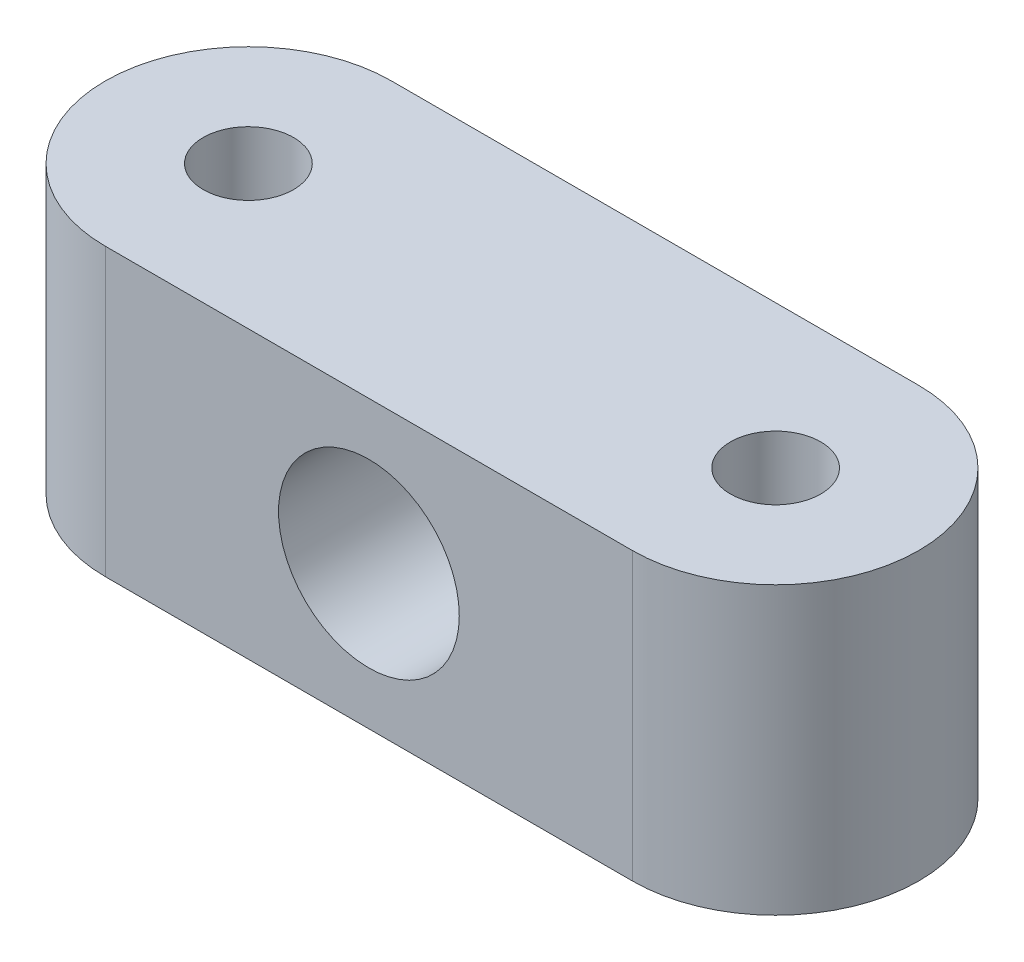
ISO-10303-21;
HEADER;
FILE_DESCRIPTION(('STEP AP214'),'2;1');
FILE_NAME('part.step','',(''),(''),'','','');
FILE_SCHEMA(('AUTOMOTIVE_DESIGN { 1 0 10303 214 1 1 1 1 }'));
ENDSEC;
DATA;
#1=APPLICATION_CONTEXT('core data for automotive mechanical design processes');
#2=APPLICATION_PROTOCOL_DEFINITION('international standard','automotive_design',2000,#1);
#3=PRODUCT_CONTEXT('',#1,'mechanical');
#4=PRODUCT('Part','Part','',(#3));
#5=PRODUCT_RELATED_PRODUCT_CATEGORY('part','',(#4));
#6=PRODUCT_DEFINITION_FORMATION('','',#4);
#7=PRODUCT_DEFINITION_CONTEXT('part definition',#1,'design');
#8=PRODUCT_DEFINITION('design','',#6,#7);
#9=PRODUCT_DEFINITION_SHAPE('','',#8);
#10=(LENGTH_UNIT() NAMED_UNIT(*) SI_UNIT(.MILLI.,.METRE.));
#11=(NAMED_UNIT(*) PLANE_ANGLE_UNIT() SI_UNIT($,.RADIAN.));
#12=(NAMED_UNIT(*) SI_UNIT($,.STERADIAN.) SOLID_ANGLE_UNIT());
#13=UNCERTAINTY_MEASURE_WITH_UNIT(LENGTH_MEASURE(1.E-05),#10,'distance_accuracy_value','');
#14=(GEOMETRIC_REPRESENTATION_CONTEXT(3) GLOBAL_UNCERTAINTY_ASSIGNED_CONTEXT((#13)) GLOBAL_UNIT_ASSIGNED_CONTEXT((#10,
#11,#12)) REPRESENTATION_CONTEXT('',''));
#15=CARTESIAN_POINT('',(0.,0.,0.));
#16=DIRECTION('',(0.,0.,1.));
#17=DIRECTION('',(1.,0.,0.));
#18=AXIS2_PLACEMENT_3D('',#15,#16,#17);
#19=CARTESIAN_POINT('',(0.,38.,0.));
#20=DIRECTION('',(0.,1.,0.));
#21=DIRECTION('',(0.,0.,1.));
#22=AXIS2_PLACEMENT_3D('',#19,#20,#21);
#23=PLANE('',#22);
#24=CARTESIAN_POINT('',(0.,38.,0.));
#25=DIRECTION('',(0.,1.,0.));
#26=DIRECTION('',(0.,0.,1.));
#27=AXIS2_PLACEMENT_3D('',#24,#25,#26);
#28=CIRCLE('',#27,6.);
#29=CARTESIAN_POINT('',(0.,38.,6.));
#30=VERTEX_POINT('',#29);
#31=EDGE_CURVE('E112',#30,#30,#28,.T.);
#32=ORIENTED_EDGE('',*,*,#31,.F.);
#33=EDGE_LOOP('',(#32));
#34=FACE_BOUND('',#33,.T.);
#35=CARTESIAN_POINT('',(0.,38.,0.));
#36=DIRECTION('',(0.,1.,0.));
#37=DIRECTION('',(0.,0.,1.));
#38=AXIS2_PLACEMENT_3D('',#35,#36,#37);
#39=CIRCLE('',#38,19.);
#40=CARTESIAN_POINT('',(0.,38.,-19.));
#41=VERTEX_POINT('',#40);
#42=CARTESIAN_POINT('',(0.,38.,19.));
#43=VERTEX_POINT('',#42);
#44=EDGE_CURVE('E97',#41,#43,#39,.T.);
#45=ORIENTED_EDGE('',*,*,#44,.T.);
#46=DIRECTION('',(1.,0.,0.));
#47=VECTOR('',#46,1.);
#48=CARTESIAN_POINT('',(0.,38.,19.));
#49=LINE('',#48,#47);
#50=CARTESIAN_POINT('',(70.,38.,19.));
#51=VERTEX_POINT('',#50);
#52=EDGE_CURVE('E92',#43,#51,#49,.T.);
#53=ORIENTED_EDGE('',*,*,#52,.T.);
#54=CARTESIAN_POINT('',(70.,38.,0.));
#55=DIRECTION('',(0.,1.,0.));
#56=DIRECTION('',(0.,0.,1.));
#57=AXIS2_PLACEMENT_3D('',#54,#55,#56);
#58=CIRCLE('',#57,19.);
#59=CARTESIAN_POINT('',(70.,38.,-19.));
#60=VERTEX_POINT('',#59);
#61=EDGE_CURVE('E95',#51,#60,#58,.T.);
#62=ORIENTED_EDGE('',*,*,#61,.T.);
#63=DIRECTION('',(-1.,0.,0.));
#64=VECTOR('',#63,1.);
#65=CARTESIAN_POINT('',(0.,38.,-19.));
#66=LINE('',#65,#64);
#67=EDGE_CURVE('E62',#60,#41,#66,.T.);
#68=ORIENTED_EDGE('',*,*,#67,.T.);
#69=EDGE_LOOP('',(#45,#53,#62,#68));
#70=FACE_BOUND('',#69,.T.);
#71=CARTESIAN_POINT('',(70.,38.,0.));
#72=DIRECTION('',(0.,1.,0.));
#73=DIRECTION('',(0.,0.,1.));
#74=AXIS2_PLACEMENT_3D('',#71,#72,#73);
#75=CIRCLE('',#74,6.);
#76=CARTESIAN_POINT('',(70.,38.,6.));
#77=VERTEX_POINT('',#76);
#78=EDGE_CURVE('E127',#77,#77,#75,.T.);
#79=ORIENTED_EDGE('',*,*,#78,.F.);
#80=EDGE_LOOP('',(#79));
#81=FACE_BOUND('',#80,.T.);
#82=ADVANCED_FACE('F45',(#34,#70,#81),#23,.T.);
#83=CARTESIAN_POINT('',(0.,0.,0.));
#84=DIRECTION('',(0.,1.,0.));
#85=DIRECTION('',(0.,0.,1.));
#86=AXIS2_PLACEMENT_3D('',#83,#84,#85);
#87=PLANE('',#86);
#88=CARTESIAN_POINT('',(0.,0.,0.));
#89=DIRECTION('',(0.,1.,0.));
#90=DIRECTION('',(0.,0.,1.));
#91=AXIS2_PLACEMENT_3D('',#88,#89,#90);
#92=CIRCLE('',#91,19.);
#93=CARTESIAN_POINT('',(0.,0.,-19.));
#94=VERTEX_POINT('',#93);
#95=CARTESIAN_POINT('',(0.,0.,19.));
#96=VERTEX_POINT('',#95);
#97=EDGE_CURVE('E109',#94,#96,#92,.T.);
#98=ORIENTED_EDGE('',*,*,#97,.F.);
#99=DIRECTION('',(-1.,0.,0.));
#100=VECTOR('',#99,1.);
#101=CARTESIAN_POINT('',(0.,0.,-19.));
#102=LINE('',#101,#100);
#103=CARTESIAN_POINT('',(70.,0.,-19.));
#104=VERTEX_POINT('',#103);
#105=EDGE_CURVE('E85',#104,#94,#102,.T.);
#106=ORIENTED_EDGE('',*,*,#105,.F.);
#107=CARTESIAN_POINT('',(70.,0.,0.));
#108=DIRECTION('',(0.,1.,0.));
#109=DIRECTION('',(0.,0.,1.));
#110=AXIS2_PLACEMENT_3D('',#107,#108,#109);
#111=CIRCLE('',#110,19.);
#112=CARTESIAN_POINT('',(70.,0.,19.));
#113=VERTEX_POINT('',#112);
#114=EDGE_CURVE('E79',#113,#104,#111,.T.);
#115=ORIENTED_EDGE('',*,*,#114,.F.);
#116=DIRECTION('',(1.,0.,0.));
#117=VECTOR('',#116,1.);
#118=CARTESIAN_POINT('',(0.,0.,19.));
#119=LINE('',#118,#117);
#120=EDGE_CURVE('E101',#96,#113,#119,.T.);
#121=ORIENTED_EDGE('',*,*,#120,.F.);
#122=EDGE_LOOP('',(#98,#106,#115,#121));
#123=FACE_BOUND('',#122,.T.);
#124=CARTESIAN_POINT('',(0.,0.,0.));
#125=DIRECTION('',(0.,1.,0.));
#126=DIRECTION('',(0.,0.,1.));
#127=AXIS2_PLACEMENT_3D('',#124,#125,#126);
#128=CIRCLE('',#127,6.);
#129=CARTESIAN_POINT('',(0.,0.,6.));
#130=VERTEX_POINT('',#129);
#131=EDGE_CURVE('E124',#130,#130,#128,.T.);
#132=ORIENTED_EDGE('',*,*,#131,.T.);
#133=EDGE_LOOP('',(#132));
#134=FACE_BOUND('',#133,.T.);
#135=CARTESIAN_POINT('',(70.,0.,0.));
#136=DIRECTION('',(0.,1.,0.));
#137=DIRECTION('',(0.,0.,1.));
#138=AXIS2_PLACEMENT_3D('',#135,#136,#137);
#139=CIRCLE('',#138,6.);
#140=CARTESIAN_POINT('',(70.,0.,6.));
#141=VERTEX_POINT('',#140);
#142=EDGE_CURVE('E130',#141,#141,#139,.T.);
#143=ORIENTED_EDGE('',*,*,#142,.T.);
#144=EDGE_LOOP('',(#143));
#145=FACE_BOUND('',#144,.T.);
#146=ADVANCED_FACE('F120',(#123,#134,#145),#87,.F.);
#147=CARTESIAN_POINT('',(0.,38.,0.));
#148=DIRECTION('',(0.,-1.,0.));
#149=DIRECTION('',(0.,0.,-1.));
#150=AXIS2_PLACEMENT_3D('',#147,#148,#149);
#151=CYLINDRICAL_SURFACE('',#150,19.);
#152=ORIENTED_EDGE('',*,*,#97,.T.);
#153=DIRECTION('',(0.,-1.,0.));
#154=VECTOR('',#153,1.);
#155=CARTESIAN_POINT('',(0.,38.,19.));
#156=LINE('',#155,#154);
#157=EDGE_CURVE('E11',#43,#96,#156,.T.);
#158=ORIENTED_EDGE('',*,*,#157,.F.);
#159=ORIENTED_EDGE('',*,*,#44,.F.);
#160=DIRECTION('',(0.,-1.,0.));
#161=VECTOR('',#160,1.);
#162=CARTESIAN_POINT('',(0.,38.,-19.));
#163=LINE('',#162,#161);
#164=EDGE_CURVE('E105',#41,#94,#163,.T.);
#165=ORIENTED_EDGE('',*,*,#164,.T.);
#166=EDGE_LOOP('',(#152,#158,#159,#165));
#167=FACE_BOUND('',#166,.T.);
#168=ADVANCED_FACE('F47',(#167),#151,.T.);
#169=CARTESIAN_POINT('',(0.,38.,19.));
#170=DIRECTION('',(0.,0.,-1.));
#171=DIRECTION('',(-1.,0.,0.));
#172=AXIS2_PLACEMENT_3D('',#169,#170,#171);
#173=PLANE('',#172);
#174=CARTESIAN_POINT('',(35.,19.,19.));
#175=DIRECTION('',(0.,0.,1.));
#176=DIRECTION('',(1.,0.,0.));
#177=AXIS2_PLACEMENT_3D('',#174,#175,#176);
#178=CIRCLE('',#177,12.);
#179=CARTESIAN_POINT('',(47.,19.,19.));
#180=VERTEX_POINT('',#179);
#181=EDGE_CURVE('E136',#180,#180,#178,.T.);
#182=ORIENTED_EDGE('',*,*,#181,.F.);
#183=EDGE_LOOP('',(#182));
#184=FACE_BOUND('',#183,.T.);
#185=ORIENTED_EDGE('',*,*,#120,.T.);
#186=DIRECTION('',(0.,-1.,0.));
#187=VECTOR('',#186,1.);
#188=CARTESIAN_POINT('',(70.,38.,19.));
#189=LINE('',#188,#187);
#190=EDGE_CURVE('E54',#51,#113,#189,.T.);
#191=ORIENTED_EDGE('',*,*,#190,.F.);
#192=ORIENTED_EDGE('',*,*,#52,.F.);
#193=ORIENTED_EDGE('',*,*,#157,.T.);
#194=EDGE_LOOP('',(#185,#191,#192,#193));
#195=FACE_BOUND('',#194,.T.);
#196=ADVANCED_FACE('F100',(#184,#195),#173,.F.);
#197=CARTESIAN_POINT('',(70.,38.,0.));
#198=DIRECTION('',(0.,-1.,0.));
#199=DIRECTION('',(0.,0.,-1.));
#200=AXIS2_PLACEMENT_3D('',#197,#198,#199);
#201=CYLINDRICAL_SURFACE('',#200,19.);
#202=ORIENTED_EDGE('',*,*,#114,.T.);
#203=DIRECTION('',(0.,-1.,0.));
#204=VECTOR('',#203,1.);
#205=CARTESIAN_POINT('',(70.,38.,-19.));
#206=LINE('',#205,#204);
#207=EDGE_CURVE('E102',#60,#104,#206,.T.);
#208=ORIENTED_EDGE('',*,*,#207,.F.);
#209=ORIENTED_EDGE('',*,*,#61,.F.);
#210=ORIENTED_EDGE('',*,*,#190,.T.);
#211=EDGE_LOOP('',(#202,#208,#209,#210));
#212=FACE_BOUND('',#211,.T.);
#213=ADVANCED_FACE('F103',(#212),#201,.T.);
#214=CARTESIAN_POINT('',(0.,38.,-19.));
#215=DIRECTION('',(0.,0.,1.));
#216=DIRECTION('',(1.,0.,0.));
#217=AXIS2_PLACEMENT_3D('',#214,#215,#216);
#218=PLANE('',#217);
#219=CARTESIAN_POINT('',(35.,19.,-19.));
#220=DIRECTION('',(0.,0.,1.));
#221=DIRECTION('',(1.,0.,0.));
#222=AXIS2_PLACEMENT_3D('',#219,#220,#221);
#223=CIRCLE('',#222,12.);
#224=CARTESIAN_POINT('',(47.,19.,-19.));
#225=VERTEX_POINT('',#224);
#226=EDGE_CURVE('E133',#225,#225,#223,.T.);
#227=ORIENTED_EDGE('',*,*,#226,.T.);
#228=EDGE_LOOP('',(#227));
#229=FACE_BOUND('',#228,.T.);
#230=ORIENTED_EDGE('',*,*,#105,.T.);
#231=ORIENTED_EDGE('',*,*,#164,.F.);
#232=ORIENTED_EDGE('',*,*,#67,.F.);
#233=ORIENTED_EDGE('',*,*,#207,.T.);
#234=EDGE_LOOP('',(#230,#231,#232,#233));
#235=FACE_BOUND('',#234,.T.);
#236=ADVANCED_FACE('F117',(#229,#235),#218,.F.);
#237=CARTESIAN_POINT('',(0.,38.,0.));
#238=DIRECTION('',(0.,-1.,0.));
#239=DIRECTION('',(0.,0.,-1.));
#240=AXIS2_PLACEMENT_3D('',#237,#238,#239);
#241=CYLINDRICAL_SURFACE('',#240,6.);
#242=ORIENTED_EDGE('',*,*,#31,.T.);
#243=EDGE_LOOP('',(#242));
#244=FACE_BOUND('',#243,.T.);
#245=ORIENTED_EDGE('',*,*,#131,.F.);
#246=EDGE_LOOP('',(#245));
#247=FACE_BOUND('',#246,.T.);
#248=ADVANCED_FACE('F165',(#244,#247),#241,.F.);
#249=CARTESIAN_POINT('',(70.,38.,0.));
#250=DIRECTION('',(0.,-1.,0.));
#251=DIRECTION('',(0.,0.,-1.));
#252=AXIS2_PLACEMENT_3D('',#249,#250,#251);
#253=CYLINDRICAL_SURFACE('',#252,6.);
#254=ORIENTED_EDGE('',*,*,#78,.T.);
#255=EDGE_LOOP('',(#254));
#256=FACE_BOUND('',#255,.T.);
#257=ORIENTED_EDGE('',*,*,#142,.F.);
#258=EDGE_LOOP('',(#257));
#259=FACE_BOUND('',#258,.T.);
#260=ADVANCED_FACE('F146',(#256,#259),#253,.F.);
#261=CARTESIAN_POINT('',(35.,19.,-19.));
#262=DIRECTION('',(0.,0.,1.));
#263=DIRECTION('',(1.,0.,0.));
#264=AXIS2_PLACEMENT_3D('',#261,#262,#263);
#265=CYLINDRICAL_SURFACE('',#264,12.);
#266=ORIENTED_EDGE('',*,*,#226,.F.);
#267=EDGE_LOOP('',(#266));
#268=FACE_BOUND('',#267,.T.);
#269=ORIENTED_EDGE('',*,*,#181,.T.);
#270=EDGE_LOOP('',(#269));
#271=FACE_BOUND('',#270,.T.);
#272=ADVANCED_FACE('F143',(#268,#271),#265,.F.);
#273=CLOSED_SHELL('',(#82,#146,#168,#196,#213,#236,#248,#260,#272));
#274=MANIFOLD_SOLID_BREP('B2',#273);
#275=ADVANCED_BREP_SHAPE_REPRESENTATION('',(#18,#274),#14);
#276=SHAPE_DEFINITION_REPRESENTATION(#9,#275);
ENDSEC;
END-ISO-10303-21;
